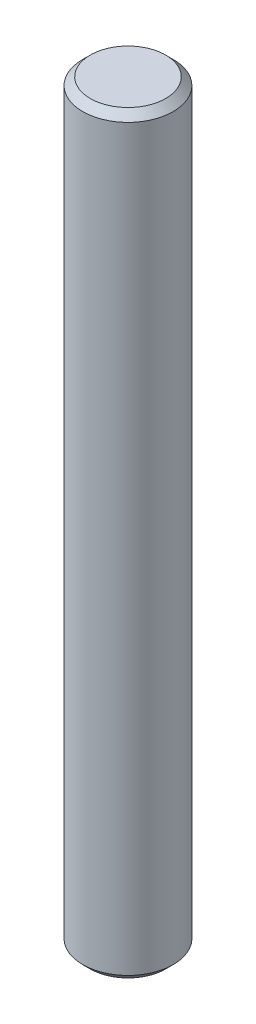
ISO-10303-21;
HEADER;
FILE_DESCRIPTION(('STEP AP214'),'2;1');
FILE_NAME('part.step','',(''),(''),'','','');
FILE_SCHEMA(('AUTOMOTIVE_DESIGN { 1 0 10303 214 1 1 1 1 }'));
ENDSEC;
DATA;
#1=APPLICATION_CONTEXT('core data for automotive mechanical design processes');
#2=APPLICATION_PROTOCOL_DEFINITION('international standard','automotive_design',2000,#1);
#3=PRODUCT_CONTEXT('',#1,'mechanical');
#4=PRODUCT('Part','Part','',(#3));
#5=PRODUCT_RELATED_PRODUCT_CATEGORY('part','',(#4));
#6=PRODUCT_DEFINITION_FORMATION('','',#4);
#7=PRODUCT_DEFINITION_CONTEXT('part definition',#1,'design');
#8=PRODUCT_DEFINITION('design','',#6,#7);
#9=PRODUCT_DEFINITION_SHAPE('','',#8);
#10=(LENGTH_UNIT() NAMED_UNIT(*) SI_UNIT(.MILLI.,.METRE.));
#11=(NAMED_UNIT(*) PLANE_ANGLE_UNIT() SI_UNIT($,.RADIAN.));
#12=(NAMED_UNIT(*) SI_UNIT($,.STERADIAN.) SOLID_ANGLE_UNIT());
#13=UNCERTAINTY_MEASURE_WITH_UNIT(LENGTH_MEASURE(1.E-05),#10,'distance_accuracy_value','');
#14=(GEOMETRIC_REPRESENTATION_CONTEXT(3) GLOBAL_UNCERTAINTY_ASSIGNED_CONTEXT((#13)) GLOBAL_UNIT_ASSIGNED_CONTEXT((#10,
#11,#12)) REPRESENTATION_CONTEXT('',''));
#15=CARTESIAN_POINT('',(0.,0.,0.));
#16=DIRECTION('',(0.,0.,1.));
#17=DIRECTION('',(1.,0.,0.));
#18=AXIS2_PLACEMENT_3D('',#15,#16,#17);
#19=CARTESIAN_POINT('',(0.,25.,0.));
#20=DIRECTION('',(0.,-1.,0.));
#21=DIRECTION('',(0.,0.,-1.));
#22=AXIS2_PLACEMENT_3D('',#19,#20,#21);
#23=CYLINDRICAL_SURFACE('',#22,1.5);
#24=CARTESIAN_POINT('',(0.,24.75,0.));
#25=DIRECTION('',(0.,1.,0.));
#26=DIRECTION('',(0.,0.,1.));
#27=AXIS2_PLACEMENT_3D('',#24,#25,#26);
#28=CIRCLE('',#27,1.5);
#29=CARTESIAN_POINT('',(0.,24.75,1.5));
#30=VERTEX_POINT('',#29);
#31=EDGE_CURVE('E41',#30,#30,#28,.F.);
#32=ORIENTED_EDGE('',*,*,#31,.T.);
#33=EDGE_LOOP('',(#32));
#34=FACE_BOUND('',#33,.T.);
#35=CARTESIAN_POINT('',(0.,0.25,0.));
#36=DIRECTION('',(0.,1.,0.));
#37=DIRECTION('',(0.,0.,1.));
#38=AXIS2_PLACEMENT_3D('',#35,#36,#37);
#39=CIRCLE('',#38,1.5);
#40=CARTESIAN_POINT('',(0.,0.25,1.5));
#41=VERTEX_POINT('',#40);
#42=EDGE_CURVE('E45',#41,#41,#39,.T.);
#43=ORIENTED_EDGE('',*,*,#42,.T.);
#44=EDGE_LOOP('',(#43));
#45=FACE_BOUND('',#44,.T.);
#46=ADVANCED_FACE('F33',(#34,#45),#23,.T.);
#47=CARTESIAN_POINT('',(0.,25.,0.));
#48=DIRECTION('',(0.,1.,0.));
#49=DIRECTION('',(0.,0.,1.));
#50=AXIS2_PLACEMENT_3D('',#47,#48,#49);
#51=PLANE('',#50);
#52=CARTESIAN_POINT('',(0.,25.,0.));
#53=DIRECTION('',(0.,1.,0.));
#54=DIRECTION('',(0.,0.,1.));
#55=AXIS2_PLACEMENT_3D('',#52,#53,#54);
#56=CIRCLE('',#55,1.25);
#57=CARTESIAN_POINT('',(0.,25.,1.25));
#58=VERTEX_POINT('',#57);
#59=EDGE_CURVE('E49',#58,#58,#56,.T.);
#60=ORIENTED_EDGE('',*,*,#59,.T.);
#61=EDGE_LOOP('',(#60));
#62=FACE_BOUND('',#61,.T.);
#63=ADVANCED_FACE('F55',(#62),#51,.T.);
#64=CARTESIAN_POINT('',(0.,0.,0.));
#65=DIRECTION('',(0.,1.,0.));
#66=DIRECTION('',(0.,0.,1.));
#67=AXIS2_PLACEMENT_3D('',#64,#65,#66);
#68=PLANE('',#67);
#69=CARTESIAN_POINT('',(0.,0.,0.));
#70=DIRECTION('',(0.,1.,0.));
#71=DIRECTION('',(0.,0.,1.));
#72=AXIS2_PLACEMENT_3D('',#69,#70,#71);
#73=CIRCLE('',#72,1.25);
#74=CARTESIAN_POINT('',(0.,0.,1.25));
#75=VERTEX_POINT('',#74);
#76=EDGE_CURVE('E10',#75,#75,#73,.F.);
#77=ORIENTED_EDGE('',*,*,#76,.T.);
#78=EDGE_LOOP('',(#77));
#79=FACE_BOUND('',#78,.T.);
#80=ADVANCED_FACE('F59',(#79),#68,.F.);
#81=CARTESIAN_POINT('',(0.,25.,0.));
#82=DIRECTION('',(0.,-1.,0.));
#83=DIRECTION('',(0.,0.,-1.));
#84=AXIS2_PLACEMENT_3D('',#81,#82,#83);
#85=CONICAL_SURFACE('',#84,1.25,0.785398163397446);
#86=ORIENTED_EDGE('',*,*,#31,.F.);
#87=EDGE_LOOP('',(#86));
#88=FACE_BOUND('',#87,.T.);
#89=ORIENTED_EDGE('',*,*,#59,.F.);
#90=EDGE_LOOP('',(#89));
#91=FACE_BOUND('',#90,.T.);
#92=ADVANCED_FACE('F57',(#88,#91),#85,.T.);
#93=CARTESIAN_POINT('',(0.,0.25,0.));
#94=DIRECTION('',(0.,1.,0.));
#95=DIRECTION('',(0.,0.,1.));
#96=AXIS2_PLACEMENT_3D('',#93,#94,#95);
#97=CONICAL_SURFACE('',#96,1.5,0.785398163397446);
#98=ORIENTED_EDGE('',*,*,#76,.F.);
#99=EDGE_LOOP('',(#98));
#100=FACE_BOUND('',#99,.T.);
#101=ORIENTED_EDGE('',*,*,#42,.F.);
#102=EDGE_LOOP('',(#101));
#103=FACE_BOUND('',#102,.T.);
#104=ADVANCED_FACE('F36',(#100,#103),#97,.T.);
#105=CLOSED_SHELL('',(#46,#63,#80,#92,#104));
#106=MANIFOLD_SOLID_BREP('B2',#105);
#107=ADVANCED_BREP_SHAPE_REPRESENTATION('',(#18,#106),#14);
#108=SHAPE_DEFINITION_REPRESENTATION(#9,#107);
ENDSEC;
END-ISO-10303-21;
